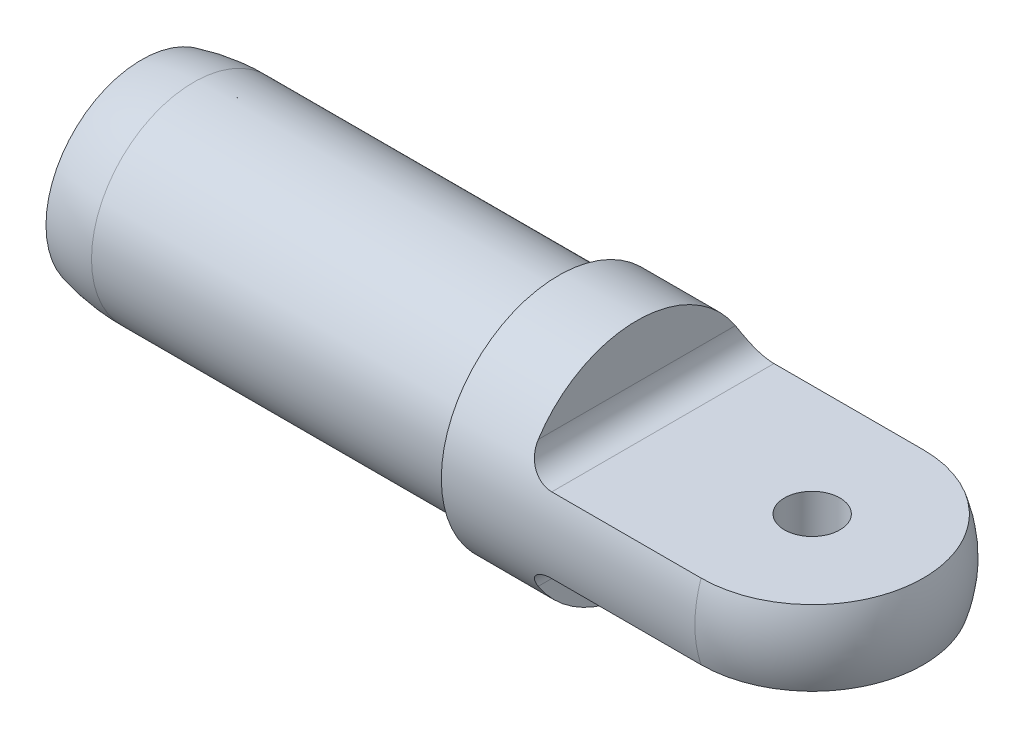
ISO-10303-21;
HEADER;
FILE_DESCRIPTION(('STEP AP214'),'2;1');
FILE_NAME('part.step','',(''),(''),'','','');
FILE_SCHEMA(('AUTOMOTIVE_DESIGN { 1 0 10303 214 1 1 1 1 }'));
ENDSEC;
DATA;
#1=APPLICATION_CONTEXT('core data for automotive mechanical design processes');
#2=APPLICATION_PROTOCOL_DEFINITION('international standard','automotive_design',2000,#1);
#3=PRODUCT_CONTEXT('',#1,'mechanical');
#4=PRODUCT('Part','Part','',(#3));
#5=PRODUCT_RELATED_PRODUCT_CATEGORY('part','',(#4));
#6=PRODUCT_DEFINITION_FORMATION('','',#4);
#7=PRODUCT_DEFINITION_CONTEXT('part definition',#1,'design');
#8=PRODUCT_DEFINITION('design','',#6,#7);
#9=PRODUCT_DEFINITION_SHAPE('','',#8);
#10=(LENGTH_UNIT() NAMED_UNIT(*) SI_UNIT(.MILLI.,.METRE.));
#11=(NAMED_UNIT(*) PLANE_ANGLE_UNIT() SI_UNIT($,.RADIAN.));
#12=(NAMED_UNIT(*) SI_UNIT($,.STERADIAN.) SOLID_ANGLE_UNIT());
#13=UNCERTAINTY_MEASURE_WITH_UNIT(LENGTH_MEASURE(1.E-05),#10,'distance_accuracy_value','');
#14=(GEOMETRIC_REPRESENTATION_CONTEXT(3) GLOBAL_UNCERTAINTY_ASSIGNED_CONTEXT((#13)) GLOBAL_UNIT_ASSIGNED_CONTEXT((#10,
#11,#12)) REPRESENTATION_CONTEXT('',''));
#15=CARTESIAN_POINT('',(0.,0.,0.));
#16=DIRECTION('',(0.,0.,1.));
#17=DIRECTION('',(1.,0.,0.));
#18=AXIS2_PLACEMENT_3D('',#15,#16,#17);
#19=CARTESIAN_POINT('',(-63.5469861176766,35.8499879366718,-55.5576157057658));
#20=DIRECTION('',(-1.,0.,0.));
#21=DIRECTION('',(0.,0.,1.));
#22=AXIS2_PLACEMENT_3D('',#19,#20,#21);
#23=CYLINDRICAL_SURFACE('',#22,14.2875);
#24=CARTESIAN_POINT('',(-12.7469861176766,35.8499879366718,-55.5576157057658));
#25=DIRECTION('',(-1.,0.,0.));
#26=DIRECTION('',(0.,0.,1.));
#27=AXIS2_PLACEMENT_3D('',#24,#25,#26);
#28=CIRCLE('',#27,14.2875);
#29=CARTESIAN_POINT('',(-12.7469861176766,35.8499879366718,-41.2701157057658));
#30=VERTEX_POINT('',#29);
#31=EDGE_CURVE('E166',#30,#30,#28,.T.);
#32=ORIENTED_EDGE('',*,*,#31,.F.);
#33=EDGE_LOOP('',(#32));
#34=FACE_BOUND('',#33,.T.);
#35=CARTESIAN_POINT('',(18.1394138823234,35.8499879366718,-55.5576157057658));
#36=DIRECTION('',(-1.,0.,0.));
#37=DIRECTION('',(0.,0.,1.));
#38=AXIS2_PLACEMENT_3D('',#35,#36,#37);
#39=CIRCLE('',#38,14.2875);
#40=CARTESIAN_POINT('',(18.1394138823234,31.2779879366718,-42.021387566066));
#41=VERTEX_POINT('',#40);
#42=CARTESIAN_POINT('',(18.1394138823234,40.4219879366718,-42.021387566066));
#43=VERTEX_POINT('',#42);
#44=EDGE_CURVE('E178',#41,#43,#39,.T.);
#45=ORIENTED_EDGE('',*,*,#44,.T.);
#46=DIRECTION('',(-1.,0.,0.));
#47=VECTOR('',#46,1.);
#48=CARTESIAN_POINT('',(-63.5469861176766,40.4219879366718,-42.021387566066));
#49=LINE('',#48,#47);
#50=CARTESIAN_POINT('',(-0.0469861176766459,40.4219879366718,-42.021387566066));
#51=VERTEX_POINT('',#50);
#52=EDGE_CURVE('E55',#43,#51,#49,.T.);
#53=ORIENTED_EDGE('',*,*,#52,.T.);
#54=CARTESIAN_POINT('',(3.12801388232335,43.5969879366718,-43.5527563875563));
#55=CARTESIAN_POINT('',(3.12801237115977,43.4146458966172,-43.4350926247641));
#56=CARTESIAN_POINT('',(3.11229997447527,43.2294096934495,-43.3214807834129));
#57=CARTESIAN_POINT('',(3.0465874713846,42.8581098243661,-43.1051052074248));
#58=CARTESIAN_POINT('',(2.9965434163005,42.6720454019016,-43.0023555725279));
#59=CARTESIAN_POINT('',(2.89424941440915,42.3972211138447,-42.8581148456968));
#60=CARTESIAN_POINT('',(2.85541806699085,42.3059946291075,-42.8115276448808));
#61=CARTESIAN_POINT('',(2.76855659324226,42.1261732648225,-42.7220323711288));
#62=CARTESIAN_POINT('',(2.72053089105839,42.0375771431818,-42.6791225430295));
#63=CARTESIAN_POINT('',(2.61536903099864,41.8641368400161,-42.5972193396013));
#64=CARTESIAN_POINT('',(2.55823824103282,41.7792904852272,-42.5582236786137));
#65=CARTESIAN_POINT('',(2.43508119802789,41.6144270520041,-42.4842819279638));
#66=CARTESIAN_POINT('',(2.36905633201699,41.5344092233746,-42.449335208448));
#67=CARTESIAN_POINT('',(2.23707981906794,41.3897140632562,-42.3875925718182));
#68=CARTESIAN_POINT('',(2.17209580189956,41.324354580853,-42.3603222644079));
#69=CARTESIAN_POINT('',(2.03595623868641,41.1989589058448,-42.3090023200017));
#70=CARTESIAN_POINT('',(1.96479863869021,41.1389244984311,-42.2849537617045));
#71=CARTESIAN_POINT('',(1.81687748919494,41.0249569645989,-42.2401045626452));
#72=CARTESIAN_POINT('',(1.74011810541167,40.9710193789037,-42.2193015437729));
#73=CARTESIAN_POINT('',(1.58154606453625,40.8698332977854,-42.1808921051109));
#74=CARTESIAN_POINT('',(1.49973167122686,40.822587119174,-42.1632867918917));
#75=CARTESIAN_POINT('',(1.26188762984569,40.6991583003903,-42.1179177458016));
#76=CARTESIAN_POINT('',(1.10059529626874,40.6314854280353,-42.0938427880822));
#77=CARTESIAN_POINT('',(0.768094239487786,40.523412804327,-42.055946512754));
#78=CARTESIAN_POINT('',(0.596887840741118,40.4830066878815,-42.0421228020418));
#79=CARTESIAN_POINT('',(0.255011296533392,40.4318086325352,-42.0246824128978));
#80=CARTESIAN_POINT('',(0.0844877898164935,40.4201408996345,-42.0207637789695));
#81=CARTESIAN_POINT('',(-0.256173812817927,40.4243105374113,-42.0221719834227));
#82=CARTESIAN_POINT('',(-0.426311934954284,40.4401459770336,-42.0274981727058));
#83=CARTESIAN_POINT('',(-0.760185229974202,40.4985209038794,-42.0474445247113));
#84=CARTESIAN_POINT('',(-0.923955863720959,40.5408794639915,-42.0620017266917));
#85=CARTESIAN_POINT('',(-1.24171205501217,40.650548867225,-42.1006239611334));
#86=CARTESIAN_POINT('',(-1.39569791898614,40.717858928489,-42.1246886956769));
#87=CARTESIAN_POINT('',(-1.69068177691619,40.8754028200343,-42.1828289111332));
#88=CARTESIAN_POINT('',(-1.83159034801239,40.9657805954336,-42.2169674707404));
#89=CARTESIAN_POINT('',(-2.09575594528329,41.1658101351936,-42.2954062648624));
#90=CARTESIAN_POINT('',(-2.21901215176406,41.2754627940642,-42.3397069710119));
#91=CARTESIAN_POINT('',(-2.44831000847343,41.5131765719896,-42.4397659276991));
#92=CARTESIAN_POINT('',(-2.55379749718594,41.6416545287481,-42.495801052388));
#93=CARTESIAN_POINT('',(-2.74172583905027,41.910019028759,-42.6181248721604));
#94=CARTESIAN_POINT('',(-2.82416180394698,42.0499079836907,-42.6844157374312));
#95=CARTESIAN_POINT('',(-2.97014594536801,42.3460709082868,-42.8311625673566));
#96=CARTESIAN_POINT('',(-3.03208013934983,42.5028163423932,-42.912266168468));
#97=CARTESIAN_POINT('',(-3.12971672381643,42.8192609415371,-43.0838693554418));
#98=CARTESIAN_POINT('',(-3.16540689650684,42.9789614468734,-43.1743732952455));
#99=CARTESIAN_POINT('',(-3.21467762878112,43.3163151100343,-43.3744522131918));
#100=CARTESIAN_POINT('',(-3.2251132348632,43.4938375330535,-43.4850143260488));
#101=CARTESIAN_POINT('',(-3.2172445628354,43.8433193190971,-43.7135033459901));
#102=CARTESIAN_POINT('',(-3.19893105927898,44.0152768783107,-43.8314326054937));
#103=CARTESIAN_POINT('',(-3.13098358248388,44.3771365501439,-44.0912525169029));
#104=CARTESIAN_POINT('',(-3.07686182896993,44.5655863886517,-44.2339869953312));
#105=CARTESIAN_POINT('',(-2.93606512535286,44.9280579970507,-44.5224433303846));
#106=CARTESIAN_POINT('',(-2.84933008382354,45.1020524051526,-44.6681702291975));
#107=CARTESIAN_POINT('',(-2.68935399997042,45.3606739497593,-44.8948277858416));
#108=CARTESIAN_POINT('',(-2.62658180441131,45.4513253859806,-44.9764432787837));
#109=CARTESIAN_POINT('',(-2.49112696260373,45.626536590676,-45.1381177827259));
#110=CARTESIAN_POINT('',(-2.4184410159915,45.7110943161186,-45.218176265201));
#111=CARTESIAN_POINT('',(-2.26323558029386,45.8732652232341,-45.3753127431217));
#112=CARTESIAN_POINT('',(-2.18073575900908,45.9508917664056,-45.4523963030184));
#113=CARTESIAN_POINT('',(-2.0056060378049,46.0984946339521,-45.6021243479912));
#114=CARTESIAN_POINT('',(-1.91298418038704,46.1684769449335,-45.6747722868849));
#115=CARTESIAN_POINT('',(-1.70342063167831,46.3089870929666,-45.823456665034));
#116=CARTESIAN_POINT('',(-1.58489108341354,46.3782024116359,-45.898528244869));
#117=CARTESIAN_POINT('',(-1.33407922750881,46.5027661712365,-46.0360834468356));
#118=CARTESIAN_POINT('',(-1.20182168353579,46.5581389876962,-46.0985891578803));
#119=CARTESIAN_POINT('',(-0.950351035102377,46.6430875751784,-46.1957228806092));
#120=CARTESIAN_POINT('',(-0.833303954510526,46.6755483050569,-46.2333758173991));
#121=CARTESIAN_POINT('',(-0.592563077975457,46.72717593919,-46.2936513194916));
#122=CARTESIAN_POINT('',(-0.468875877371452,46.7463557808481,-46.3162885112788));
#123=CARTESIAN_POINT('',(-0.217346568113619,46.7699408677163,-46.344166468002));
#124=CARTESIAN_POINT('',(-0.0894842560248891,46.774258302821,-46.3493038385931));
#125=CARTESIAN_POINT('',(0.16524339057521,46.7674487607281,-46.3412320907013));
#126=CARTESIAN_POINT('',(0.292108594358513,46.7563197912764,-46.3280206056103));
#127=CARTESIAN_POINT('',(0.529771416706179,46.7212719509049,-46.2867760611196));
#128=CARTESIAN_POINT('',(0.641003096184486,46.6985587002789,-46.2601425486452));
#129=CARTESIAN_POINT('',(0.857172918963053,46.6425761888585,-46.195215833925));
#130=CARTESIAN_POINT('',(0.962108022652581,46.609301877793,-46.1569170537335));
#131=CARTESIAN_POINT('',(1.21840650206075,46.5136289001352,-46.0483037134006));
#132=CARTESIAN_POINT('',(1.36485980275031,46.4451449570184,-45.9717843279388));
#133=CARTESIAN_POINT('',(1.63990935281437,46.2914207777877,-45.8045610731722));
#134=CARTESIAN_POINT('',(1.76845531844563,46.2061349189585,-45.7138187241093));
#135=CARTESIAN_POINT('',(1.97249493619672,46.0492527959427,-45.5517987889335));
#136=CARTESIAN_POINT('',(2.05243199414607,45.9810726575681,-45.482706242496));
#137=CARTESIAN_POINT('',(2.20384628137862,45.8386810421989,-45.3415132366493));
#138=CARTESIAN_POINT('',(2.27532011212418,45.7644671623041,-45.2694115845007));
#139=CARTESIAN_POINT('',(2.47739848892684,45.5334811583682,-45.0501197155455));
#140=CARTESIAN_POINT('',(2.59562376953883,45.368393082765,-44.8999723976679));
#141=CARTESIAN_POINT('',(2.7488204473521,45.105195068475,-44.6724061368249));
#142=CARTESIAN_POINT('',(2.79625215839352,45.01375241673,-44.5952821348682));
#143=CARTESIAN_POINT('',(2.88212122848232,44.826452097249,-44.4413911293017));
#144=CARTESIAN_POINT('',(2.92055827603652,44.7305942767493,-44.3646241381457));
#145=CARTESIAN_POINT('',(3.02167696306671,44.4375201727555,-44.1362394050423));
#146=CARTESIAN_POINT('',(3.07056393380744,44.2341220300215,-43.9859443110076));
#147=CARTESIAN_POINT('',(3.10856037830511,43.9550071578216,-43.7911915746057));
#148=CARTESIAN_POINT('',(3.11580864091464,43.8841707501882,-43.7427114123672));
#149=CARTESIAN_POINT('',(3.12553683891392,43.7413713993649,-43.6468595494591));
#150=CARTESIAN_POINT('',(3.12801448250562,43.6694079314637,-43.5994883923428));
#151=CARTESIAN_POINT('',(3.12801388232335,43.5969879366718,-43.5527563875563));
#152=B_SPLINE_CURVE_WITH_KNOTS('',3,(#54,#55,#56,#57,#58,#59,#60,#61,#62,#63,#64,#65,#66,#67,
#68,#69,#70,#71,#72,#73,#74,#75,#76,#77,#78,#79,#80,#81,#82,#83,#84,#85,#86,#87,#88,#89,#90,#91,
#92,#93,#94,#95,#96,#97,#98,#99,#100,#101,#102,#103,#104,#105,#106,#107,#108,#109,#110,#111,
#112,#113,#114,#115,#116,#117,#118,#119,#120,#121,#122,#123,#124,#125,#126,#127,#128,#129,#130,
#131,#132,#133,#134,#135,#136,#137,#138,#139,#140,#141,#142,#143,#144,#145,#146,#147,#148,#149,
#150,#151),.UNSPECIFIED.,.T.,.F.,(4,2,2,2,2,2,2,2,2,2,2,2,2,2,2,2,2,2,2,2,2,2,2,2,2,2,2,2,2,2,2,
2,2,2,2,2,2,2,2,2,2,2,2,2,2,2,2,2,4),(0.,0.650749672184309,1.30233394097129,1.63057110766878,
1.95865072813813,2.28653763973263,2.61437347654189,2.90233929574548,3.19040129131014,
3.47825121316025,3.76620055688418,4.29302643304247,4.81972928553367,5.33017069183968,
5.84057626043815,6.34753747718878,6.85448280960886,7.36467236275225,7.87488559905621,
8.39886421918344,8.92295386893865,9.48177939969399,10.0408649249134,10.6666368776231,
11.292609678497,12.0173960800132,12.7435245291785,13.1546522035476,13.5659170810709,
13.9763712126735,14.3865015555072,14.854420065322,15.3215087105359,15.7015033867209,
16.0811273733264,16.4629904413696,16.844902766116,17.1933641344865,17.5419923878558,
18.0756128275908,18.6107027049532,18.9874664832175,19.3643810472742,20.1183726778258,
20.5041132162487,20.8898671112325,21.6584430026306,21.9167743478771,22.175229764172),.UNSPECIFIED.);
#153=CARTESIAN_POINT('',(-3.22198611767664,43.5969879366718,-43.5527563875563));
#154=VERTEX_POINT('',#153);
#155=EDGE_CURVE('E11',#51,#154,#152,.T.);
#156=ORIENTED_EDGE('',*,*,#155,.T.);
#157=CARTESIAN_POINT('',(-3.22198611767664,35.8499879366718,-55.5576157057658));
#158=DIRECTION('',(-1.,0.,0.));
#159=DIRECTION('',(0.,-1.,0.));
#160=AXIS2_PLACEMENT_3D('',#157,#158,#159);
#161=CIRCLE('',#160,14.2875);
#162=CARTESIAN_POINT('',(-3.22198611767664,43.5969879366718,-67.5624750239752));
#163=VERTEX_POINT('',#162);
#164=EDGE_CURVE('E111',#154,#163,#161,.T.);
#165=ORIENTED_EDGE('',*,*,#164,.T.);
#166=CARTESIAN_POINT('',(3.12801388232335,43.5969879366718,-67.5624750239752));
#167=CARTESIAN_POINT('',(3.128013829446,43.7102427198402,-67.489388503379));
#168=CARTESIAN_POINT('',(3.12195216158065,43.8224876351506,-67.4146777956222));
#169=CARTESIAN_POINT('',(3.09835804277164,44.0440484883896,-67.2626620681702));
#170=CARTESIAN_POINT('',(3.08081695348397,44.1533621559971,-67.1853551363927));
#171=CARTESIAN_POINT('',(3.03478663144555,44.3686454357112,-67.0285748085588));
#172=CARTESIAN_POINT('',(3.00626096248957,44.4746026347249,-66.9490950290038));
#173=CARTESIAN_POINT('',(2.93881567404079,44.682123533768,-66.7889676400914));
#174=CARTESIAN_POINT('',(2.89989840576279,44.7836882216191,-66.7083202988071));
#175=CARTESIAN_POINT('',(2.77116258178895,45.0743236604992,-66.4711406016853));
#176=CARTESIAN_POINT('',(2.66765872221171,45.2569631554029,-66.3137641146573));
#177=CARTESIAN_POINT('',(2.48579569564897,45.5144528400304,-66.081126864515));
#178=CARTESIAN_POINT('',(2.42075766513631,45.5975210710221,-66.0041691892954));
#179=CARTESIAN_POINT('',(2.28170477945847,45.7577904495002,-65.8522870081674));
#180=CARTESIAN_POINT('',(2.20769279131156,45.8349934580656,-65.7773618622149));
#181=CARTESIAN_POINT('',(2.01459132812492,46.0167598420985,-65.5971568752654));
#182=CARTESIAN_POINT('',(1.89035641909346,46.1177076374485,-65.4936490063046));
#183=CARTESIAN_POINT('',(1.62175917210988,46.3029909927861,-65.298530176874));
#184=CARTESIAN_POINT('',(1.47742974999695,46.3873531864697,-65.2069002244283));
#185=CARTESIAN_POINT('',(1.2096147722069,46.5154355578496,-65.0648490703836));
#186=CARTESIAN_POINT('',(1.09084606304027,46.5639936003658,-65.0099563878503));
#187=CARTESIAN_POINT('',(0.843146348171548,46.6474451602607,-64.9145171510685));
#188=CARTESIAN_POINT('',(0.714231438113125,46.6823598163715,-64.8739484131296));
#189=CARTESIAN_POINT('',(0.46852943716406,46.7319747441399,-64.81592385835));
#190=CARTESIAN_POINT('',(0.352806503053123,46.7489152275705,-64.7959210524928));
#191=CARTESIAN_POINT('',(0.11859223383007,46.7698417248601,-64.7711779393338));
#192=CARTESIAN_POINT('',(0.000102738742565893,46.7738361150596,-64.7664277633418));
#193=CARTESIAN_POINT('',(-0.236173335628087,46.7685496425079,-64.7726945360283));
#194=CARTESIAN_POINT('',(-0.353959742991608,46.7592656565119,-64.7837151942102));
#195=CARTESIAN_POINT('',(-0.585530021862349,46.7281671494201,-64.8203600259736));
#196=CARTESIAN_POINT('',(-0.699310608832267,46.7063425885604,-64.8459959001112));
#197=CARTESIAN_POINT('',(-0.951767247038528,46.643846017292,-64.9186065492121));
#198=CARTESIAN_POINT('',(-1.08839893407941,46.5995918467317,-64.9695631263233));
#199=CARTESIAN_POINT('',(-1.34903227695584,46.4961380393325,-65.0864268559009));
#200=CARTESIAN_POINT('',(-1.47300561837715,46.4369058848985,-65.1523665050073));
#201=CARTESIAN_POINT('',(-1.75814426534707,46.2782963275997,-65.3250061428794));
#202=CARTESIAN_POINT('',(-1.91250912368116,46.1725884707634,-65.437070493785));
#203=CARTESIAN_POINT('',(-2.19549504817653,45.9417580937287,-65.6727625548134));
#204=CARTESIAN_POINT('',(-2.32408440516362,45.81661199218,-65.7964042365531));
#205=CARTESIAN_POINT('',(-2.56066475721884,45.5452165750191,-66.0538752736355));
#206=CARTESIAN_POINT('',(-2.667732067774,45.3983635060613,-66.1879117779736));
#207=CARTESIAN_POINT('',(-2.85510320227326,45.0895380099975,-66.4574026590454));
#208=CARTESIAN_POINT('',(-2.93540002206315,44.9275616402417,-66.5928573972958));
#209=CARTESIAN_POINT('',(-3.0420703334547,44.6563751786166,-66.8091748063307));
#210=CARTESIAN_POINT('',(-3.07727010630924,44.5511434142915,-66.8907808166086));
#211=CARTESIAN_POINT('',(-3.1366780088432,44.3364661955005,-67.0524130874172));
#212=CARTESIAN_POINT('',(-3.16088972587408,44.227022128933,-67.1324398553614));
#213=CARTESIAN_POINT('',(-3.19772634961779,44.0046133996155,-67.2901906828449));
#214=CARTESIAN_POINT('',(-3.21035486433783,43.8916498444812,-67.3679154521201));
#215=CARTESIAN_POINT('',(-3.22336154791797,43.66308047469,-67.520355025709));
#216=CARTESIAN_POINT('',(-3.22374359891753,43.5474755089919,-67.5950707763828));
#217=CARTESIAN_POINT('',(-3.20819552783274,43.2505634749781,-67.7809252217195));
#218=CARTESIAN_POINT('',(-3.18319257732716,43.0680378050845,-67.8895344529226));
#219=CARTESIAN_POINT('',(-3.09956799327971,42.7041789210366,-68.0954107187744));
#220=CARTESIAN_POINT('',(-3.04096869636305,42.5228449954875,-68.1926852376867));
#221=CARTESIAN_POINT('',(-2.92672486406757,42.2563902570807,-68.3287091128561));
#222=CARTESIAN_POINT('',(-2.8840337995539,42.1681628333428,-68.3725540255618));
#223=CARTESIAN_POINT('',(-2.78982877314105,41.9947531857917,-68.4565986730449));
#224=CARTESIAN_POINT('',(-2.73831904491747,41.9095695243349,-68.4968001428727));
#225=CARTESIAN_POINT('',(-2.62661030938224,41.7432891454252,-68.5733771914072));
#226=CARTESIAN_POINT('',(-2.56641214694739,41.6621920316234,-68.6097531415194));
#227=CARTESIAN_POINT('',(-2.43762371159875,41.5051506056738,-68.6785584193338));
#228=CARTESIAN_POINT('',(-2.36903459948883,41.4292055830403,-68.710988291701));
#229=CARTESIAN_POINT('',(-2.23247362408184,41.2921016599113,-68.768252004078));
#230=CARTESIAN_POINT('',(-2.16537761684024,41.2302541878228,-68.7935306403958));
#231=CARTESIAN_POINT('',(-2.02542077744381,41.112070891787,-68.8409584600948));
#232=CARTESIAN_POINT('',(-1.95255803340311,41.0557369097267,-68.8631065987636));
#233=CARTESIAN_POINT('',(-1.80166142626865,40.9492997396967,-68.9042607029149));
#234=CARTESIAN_POINT('',(-1.72363160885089,40.8991917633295,-68.9232690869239));
#235=CARTESIAN_POINT('',(-1.5629605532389,40.8057333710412,-68.9582025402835));
#236=CARTESIAN_POINT('',(-1.48031771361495,40.7623853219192,-68.9741265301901));
#237=CARTESIAN_POINT('',(-1.23936406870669,40.6493470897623,-69.0151395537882));
#238=CARTESIAN_POINT('',(-1.07619158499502,40.5883997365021,-69.0365838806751));
#239=CARTESIAN_POINT('',(-0.741238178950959,40.4939319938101,-69.0694241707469));
#240=CARTESIAN_POINT('',(-0.569458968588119,40.4604061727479,-69.0808221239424));
#241=CARTESIAN_POINT('',(-0.226992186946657,40.4225439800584,-69.0936703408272));
#242=CARTESIAN_POINT('',(-0.0563979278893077,40.417452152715,-69.0953780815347));
#243=CARTESIAN_POINT('',(0.283237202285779,40.4346328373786,-69.0895693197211));
#244=CARTESIAN_POINT('',(0.452278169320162,40.4569036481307,-69.082053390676));
#245=CARTESIAN_POINT('',(0.783145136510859,40.5277881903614,-69.0576978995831));
#246=CARTESIAN_POINT('',(0.945003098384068,40.5762691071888,-69.0409053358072));
#247=CARTESIAN_POINT('',(1.25789788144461,40.6976667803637,-68.9977343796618));
#248=CARTESIAN_POINT('',(1.40893488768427,40.7705831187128,-68.9713561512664));
#249=CARTESIAN_POINT('',(1.69735440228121,40.9387935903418,-68.908451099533));
#250=CARTESIAN_POINT('',(1.83461516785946,41.0342658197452,-68.8718430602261));
#251=CARTESIAN_POINT('',(2.09069420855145,41.2436267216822,-68.7884124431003));
#252=CARTESIAN_POINT('',(2.20951256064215,41.3575153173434,-68.7415899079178));
#253=CARTESIAN_POINT('',(2.42963511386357,41.6032465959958,-68.6362639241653));
#254=CARTESIAN_POINT('',(2.5302960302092,41.7355302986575,-68.5774482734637));
#255=CARTESIAN_POINT('',(2.7081366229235,42.0105537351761,-68.4495932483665));
#256=CARTESIAN_POINT('',(2.78530295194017,42.1532993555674,-68.3805480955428));
#257=CARTESIAN_POINT('',(2.92058347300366,42.4552797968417,-68.2277946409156));
#258=CARTESIAN_POINT('',(2.97690223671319,42.6149585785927,-68.1433848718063));
#259=CARTESIAN_POINT('',(3.06291541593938,42.9361169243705,-67.9653989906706));
#260=CARTESIAN_POINT('',(3.09263517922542,43.0975946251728,-67.871831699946));
#261=CARTESIAN_POINT('',(3.11596861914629,43.3148167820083,-67.7401214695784));
#262=CARTESIAN_POINT('',(3.12050556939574,43.3715352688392,-67.705184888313));
#263=CARTESIAN_POINT('',(3.1265277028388,43.4845809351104,-67.6344564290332));
#264=CARTESIAN_POINT('',(3.12801390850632,43.5409082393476,-67.5986648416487));
#265=CARTESIAN_POINT('',(3.12801388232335,43.5969879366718,-67.5624750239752));
#266=B_SPLINE_CURVE_WITH_KNOTS('',3,(#166,#167,#168,#169,#170,#171,#172,#173,#174,#175,#176,
#177,#178,#179,#180,#181,#182,#183,#184,#185,#186,#187,#188,#189,#190,#191,#192,#193,#194,#195,
#196,#197,#198,#199,#200,#201,#202,#203,#204,#205,#206,#207,#208,#209,#210,#211,#212,#213,#214,
#215,#216,#217,#218,#219,#220,#221,#222,#223,#224,#225,#226,#227,#228,#229,#230,#231,#232,#233,
#234,#235,#236,#237,#238,#239,#240,#241,#242,#243,#244,#245,#246,#247,#248,#249,#250,#251,#252,
#253,#254,#255,#256,#257,#258,#259,#260,#261,#262,#263,#264,#265),.UNSPECIFIED.,.T.,.F.,(4,2,2,
2,2,2,2,2,2,2,2,2,2,2,2,2,2,2,2,2,2,2,2,2,2,2,2,2,2,2,2,2,2,2,2,2,2,2,2,2,2,2,2,2,2,2,2,2,2,4),
(0.,0.404290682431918,0.808885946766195,1.21483499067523,1.62069226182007,2.40387106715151,
2.79528543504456,3.18657508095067,3.75664330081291,4.32578847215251,4.74304216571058,
5.15964678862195,5.51403237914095,5.86818863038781,6.22242819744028,6.57695175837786,
7.03160059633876,7.48724509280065,8.13796276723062,8.78947611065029,9.46478123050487,
10.1402628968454,10.5530376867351,10.9656776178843,11.3781889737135,11.7905695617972,
12.4294036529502,13.0678135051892,13.3895412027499,13.7111148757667,14.0326572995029,
14.3541552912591,14.6378477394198,14.9216346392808,15.2052019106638,15.4888682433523,
16.0125367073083,16.5361014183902,17.0456869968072,17.5552408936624,18.0622366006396,
18.5692236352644,19.0803560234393,19.5914862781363,20.1181765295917,20.6451654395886,
21.2105098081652,21.7753148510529,21.9755721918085,22.1757624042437),.UNSPECIFIED.);
#267=CARTESIAN_POINT('',(-0.0469861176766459,40.4219879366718,-69.0938438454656));
#268=VERTEX_POINT('',#267);
#269=EDGE_CURVE('E48',#163,#268,#266,.T.);
#270=ORIENTED_EDGE('',*,*,#269,.T.);
#271=DIRECTION('',(-1.,0.,0.));
#272=VECTOR('',#271,1.);
#273=CARTESIAN_POINT('',(-63.5469861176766,40.4219879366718,-69.0938438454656));
#274=LINE('',#273,#272);
#275=CARTESIAN_POINT('',(18.1394138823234,40.4219879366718,-69.0938438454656));
#276=VERTEX_POINT('',#275);
#277=EDGE_CURVE('E96',#268,#276,#274,.F.);
#278=ORIENTED_EDGE('',*,*,#277,.T.);
#279=CARTESIAN_POINT('',(18.1394138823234,31.2779879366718,-69.0938438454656));
#280=VERTEX_POINT('',#279);
#281=EDGE_CURVE('E63',#276,#280,#39,.T.);
#282=ORIENTED_EDGE('',*,*,#281,.T.);
#283=DIRECTION('',(-1.,0.,0.));
#284=VECTOR('',#283,1.);
#285=CARTESIAN_POINT('',(-63.5469861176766,31.2779879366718,-69.0938438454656));
#286=LINE('',#285,#284);
#287=CARTESIAN_POINT('',(-0.0469861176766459,31.2779879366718,-69.0938438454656));
#288=VERTEX_POINT('',#287);
#289=EDGE_CURVE('E180',#280,#288,#286,.T.);
#290=ORIENTED_EDGE('',*,*,#289,.T.);
#291=CARTESIAN_POINT('',(3.12801388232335,28.1029879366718,-67.5624750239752));
#292=CARTESIAN_POINT('',(3.12801237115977,28.2853299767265,-67.6801387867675));
#293=CARTESIAN_POINT('',(3.11229997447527,28.4705661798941,-67.7937506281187));
#294=CARTESIAN_POINT('',(3.0465874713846,28.8418660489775,-68.0101262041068));
#295=CARTESIAN_POINT('',(2.9965434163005,29.027930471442,-68.1128758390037));
#296=CARTESIAN_POINT('',(2.89424941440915,29.302754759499,-68.2571165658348));
#297=CARTESIAN_POINT('',(2.85541806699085,29.3939812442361,-68.3037037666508));
#298=CARTESIAN_POINT('',(2.76855659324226,29.5738026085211,-68.3931990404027));
#299=CARTESIAN_POINT('',(2.7205308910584,29.6623987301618,-68.4361088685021));
#300=CARTESIAN_POINT('',(2.61536903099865,29.8358390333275,-68.5180120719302));
#301=CARTESIAN_POINT('',(2.55823824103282,29.9206853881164,-68.5570077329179));
#302=CARTESIAN_POINT('',(2.4350811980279,30.0855488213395,-68.6309494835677));
#303=CARTESIAN_POINT('',(2.36905633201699,30.165566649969,-68.6658962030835));
#304=CARTESIAN_POINT('',(2.23707981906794,30.3102618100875,-68.7276388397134));
#305=CARTESIAN_POINT('',(2.17209580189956,30.3756212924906,-68.7549091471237));
#306=CARTESIAN_POINT('',(2.03595623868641,30.5010169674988,-68.8062290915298));
#307=CARTESIAN_POINT('',(1.96479863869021,30.5610513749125,-68.8302776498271));
#308=CARTESIAN_POINT('',(1.81687748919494,30.6750189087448,-68.8751268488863));
#309=CARTESIAN_POINT('',(1.74011810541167,30.7289564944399,-68.8959298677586));
#310=CARTESIAN_POINT('',(1.58154606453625,30.8301425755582,-68.9343393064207));
#311=CARTESIAN_POINT('',(1.49973167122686,30.8773887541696,-68.9519446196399));
#312=CARTESIAN_POINT('',(1.26188762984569,31.0008175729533,-68.99731366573));
#313=CARTESIAN_POINT('',(1.10059529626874,31.0684904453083,-69.0213886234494));
#314=CARTESIAN_POINT('',(0.768094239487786,31.1765630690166,-69.0592848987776));
#315=CARTESIAN_POINT('',(0.596887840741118,31.2169691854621,-69.0731086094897));
#316=CARTESIAN_POINT('',(0.255011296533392,31.2681672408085,-69.0905489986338));
#317=CARTESIAN_POINT('',(0.0844877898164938,31.2798349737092,-69.0944676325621));
#318=CARTESIAN_POINT('',(-0.256173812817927,31.2756653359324,-69.0930594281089));
#319=CARTESIAN_POINT('',(-0.426311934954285,31.25982989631,-69.0877332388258));
#320=CARTESIAN_POINT('',(-0.760185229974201,31.2014549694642,-69.0677868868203));
#321=CARTESIAN_POINT('',(-0.923955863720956,31.1590964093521,-69.0532296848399));
#322=CARTESIAN_POINT('',(-1.24171205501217,31.0494270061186,-69.0146074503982));
#323=CARTESIAN_POINT('',(-1.39569791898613,30.9821169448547,-68.9905427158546));
#324=CARTESIAN_POINT('',(-1.69068177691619,30.8245730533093,-68.9324025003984));
#325=CARTESIAN_POINT('',(-1.83159034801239,30.73419527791,-68.8982639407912));
#326=CARTESIAN_POINT('',(-2.09575594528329,30.5341657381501,-68.8198251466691));
#327=CARTESIAN_POINT('',(-2.21901215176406,30.4245130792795,-68.7755244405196));
#328=CARTESIAN_POINT('',(-2.44831000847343,30.186799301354,-68.6754654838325));
#329=CARTESIAN_POINT('',(-2.55379749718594,30.0583213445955,-68.6194303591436));
#330=CARTESIAN_POINT('',(-2.74172583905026,29.7899568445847,-68.4971065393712));
#331=CARTESIAN_POINT('',(-2.82416180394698,29.6500678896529,-68.4308156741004));
#332=CARTESIAN_POINT('',(-2.97014594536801,29.3539049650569,-68.284068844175));
#333=CARTESIAN_POINT('',(-3.03208013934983,29.1971595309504,-68.2029652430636));
#334=CARTESIAN_POINT('',(-3.12971672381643,28.8807149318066,-68.0313620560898));
#335=CARTESIAN_POINT('',(-3.16540689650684,28.7210144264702,-67.9408581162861));
#336=CARTESIAN_POINT('',(-3.21467762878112,28.3836607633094,-67.7407791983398));
#337=CARTESIAN_POINT('',(-3.2251132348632,28.2061383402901,-67.6302170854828));
#338=CARTESIAN_POINT('',(-3.2172445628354,27.8566565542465,-67.4017280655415));
#339=CARTESIAN_POINT('',(-3.19893105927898,27.6846989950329,-67.2837988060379));
#340=CARTESIAN_POINT('',(-3.13098358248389,27.3228393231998,-67.0239788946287));
#341=CARTESIAN_POINT('',(-3.07686182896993,27.134389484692,-66.8812444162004));
#342=CARTESIAN_POINT('',(-2.93606512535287,26.771917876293,-66.5927880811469));
#343=CARTESIAN_POINT('',(-2.84933008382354,26.5979234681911,-66.4470611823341));
#344=CARTESIAN_POINT('',(-2.68935399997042,26.3393019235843,-66.22040362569));
#345=CARTESIAN_POINT('',(-2.62658180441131,26.248650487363,-66.1387881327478));
#346=CARTESIAN_POINT('',(-2.49112696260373,26.0734392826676,-65.9771136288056));
#347=CARTESIAN_POINT('',(-2.4184410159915,25.988881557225,-65.8970551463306));
#348=CARTESIAN_POINT('',(-2.26323558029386,25.8267106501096,-65.7399186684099));
#349=CARTESIAN_POINT('',(-2.18073575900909,25.749084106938,-65.6628351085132));
#350=CARTESIAN_POINT('',(-2.0056060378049,25.6014812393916,-65.5131070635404));
#351=CARTESIAN_POINT('',(-1.91298418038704,25.5314989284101,-65.4404591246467));
#352=CARTESIAN_POINT('',(-1.70342063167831,25.3909887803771,-65.2917747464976));
#353=CARTESIAN_POINT('',(-1.58489108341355,25.3217734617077,-65.2167031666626));
#354=CARTESIAN_POINT('',(-1.33407922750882,25.1972097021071,-65.079147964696));
#355=CARTESIAN_POINT('',(-1.20182168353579,25.1418368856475,-65.0166422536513));
#356=CARTESIAN_POINT('',(-0.950351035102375,25.0568882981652,-64.9195085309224));
#357=CARTESIAN_POINT('',(-0.833303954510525,25.0244275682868,-64.8818555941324));
#358=CARTESIAN_POINT('',(-0.592563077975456,24.9727999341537,-64.82158009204));
#359=CARTESIAN_POINT('',(-0.468875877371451,24.9536200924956,-64.7989429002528));
#360=CARTESIAN_POINT('',(-0.217346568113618,24.9300350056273,-64.7710649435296));
#361=CARTESIAN_POINT('',(-0.089484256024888,24.9257175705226,-64.7659275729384));
#362=CARTESIAN_POINT('',(0.16524339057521,24.9325271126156,-64.7739993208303));
#363=CARTESIAN_POINT('',(0.292108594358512,24.9436560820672,-64.7872108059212));
#364=CARTESIAN_POINT('',(0.529771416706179,24.9787039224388,-64.8284553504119));
#365=CARTESIAN_POINT('',(0.641003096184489,25.0014171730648,-64.8550888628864));
#366=CARTESIAN_POINT('',(0.857172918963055,25.0573996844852,-64.9200155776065));
#367=CARTESIAN_POINT('',(0.96210802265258,25.0906739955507,-64.9583143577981));
#368=CARTESIAN_POINT('',(1.21840650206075,25.1863469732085,-65.066927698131));
#369=CARTESIAN_POINT('',(1.36485980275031,25.2548309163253,-65.1434470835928));
#370=CARTESIAN_POINT('',(1.63990935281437,25.408555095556,-65.3106703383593));
#371=CARTESIAN_POINT('',(1.76845531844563,25.4938409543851,-65.4014126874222));
#372=CARTESIAN_POINT('',(1.97249493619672,25.6507230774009,-65.5634326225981));
#373=CARTESIAN_POINT('',(2.05243199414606,25.7189032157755,-65.6325251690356));
#374=CARTESIAN_POINT('',(2.20384628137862,25.8612948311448,-65.7737181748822));
#375=CARTESIAN_POINT('',(2.27532011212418,25.9355087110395,-65.8458198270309));
#376=CARTESIAN_POINT('',(2.47739848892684,26.1664947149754,-66.0651116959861));
#377=CARTESIAN_POINT('',(2.59562376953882,26.3315827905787,-66.2152590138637));
#378=CARTESIAN_POINT('',(2.7488204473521,26.5947808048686,-66.4428252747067));
#379=CARTESIAN_POINT('',(2.79625215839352,26.6862234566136,-66.5199492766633));
#380=CARTESIAN_POINT('',(2.88212122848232,26.8735237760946,-66.6738402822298));
#381=CARTESIAN_POINT('',(2.92055827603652,26.9693815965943,-66.7506072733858));
#382=CARTESIAN_POINT('',(3.02167696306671,27.2624557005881,-66.9789920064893));
#383=CARTESIAN_POINT('',(3.07056393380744,27.4658538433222,-67.129287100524));
#384=CARTESIAN_POINT('',(3.10856037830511,27.744968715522,-67.3240398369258));
#385=CARTESIAN_POINT('',(3.11580864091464,27.8158051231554,-67.3725199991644));
#386=CARTESIAN_POINT('',(3.12553683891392,27.9586044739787,-67.4683718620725));
#387=CARTESIAN_POINT('',(3.12801448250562,28.03056794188,-67.5157430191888));
#388=CARTESIAN_POINT('',(3.12801388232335,28.1029879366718,-67.5624750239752));
#389=B_SPLINE_CURVE_WITH_KNOTS('',3,(#291,#292,#293,#294,#295,#296,#297,#298,#299,#300,#301,
#302,#303,#304,#305,#306,#307,#308,#309,#310,#311,#312,#313,#314,#315,#316,#317,#318,#319,#320,
#321,#322,#323,#324,#325,#326,#327,#328,#329,#330,#331,#332,#333,#334,#335,#336,#337,#338,#339,
#340,#341,#342,#343,#344,#345,#346,#347,#348,#349,#350,#351,#352,#353,#354,#355,#356,#357,#358,
#359,#360,#361,#362,#363,#364,#365,#366,#367,#368,#369,#370,#371,#372,#373,#374,#375,#376,#377,
#378,#379,#380,#381,#382,#383,#384,#385,#386,#387,#388),.UNSPECIFIED.,.T.,.F.,(4,2,2,2,2,2,2,2,
2,2,2,2,2,2,2,2,2,2,2,2,2,2,2,2,2,2,2,2,2,2,2,2,2,2,2,2,2,2,2,2,2,2,2,2,2,2,2,2,4),(0.,
0.650749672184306,1.30233394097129,1.63057110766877,1.95865072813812,2.28653763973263,
2.61437347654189,2.90233929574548,3.19040129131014,3.47825121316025,3.76620055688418,
4.29302643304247,4.81972928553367,5.33017069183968,5.84057626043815,6.34753747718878,
6.85448280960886,7.36467236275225,7.87488559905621,8.39886421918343,8.92295386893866,
9.48177939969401,10.0408649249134,10.6666368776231,11.292609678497,12.0173960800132,
12.7435245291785,13.1546522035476,13.5659170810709,13.9763712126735,14.3865015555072,
14.854420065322,15.3215087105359,15.701503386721,16.0811273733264,16.4629904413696,
16.844902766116,17.1933641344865,17.5419923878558,18.0756128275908,18.6107027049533,
18.9874664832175,19.3643810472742,20.1183726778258,20.5041132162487,20.8898671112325,
21.6584430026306,21.9167743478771,22.175229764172),.UNSPECIFIED.);
#390=CARTESIAN_POINT('',(-3.22198611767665,28.1029879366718,-67.5624750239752));
#391=VERTEX_POINT('',#390);
#392=EDGE_CURVE('E148',#288,#391,#389,.T.);
#393=ORIENTED_EDGE('',*,*,#392,.T.);
#394=CARTESIAN_POINT('',(-3.22198611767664,35.8499879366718,-55.5576157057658));
#395=DIRECTION('',(-1.,0.,0.));
#396=DIRECTION('',(0.,-1.,0.));
#397=AXIS2_PLACEMENT_3D('',#394,#395,#396);
#398=CIRCLE('',#397,14.2875);
#399=CARTESIAN_POINT('',(-3.22198611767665,28.1029879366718,-43.5527563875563));
#400=VERTEX_POINT('',#399);
#401=EDGE_CURVE('E152',#391,#400,#398,.T.);
#402=ORIENTED_EDGE('',*,*,#401,.T.);
#403=CARTESIAN_POINT('',(3.12801388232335,28.1029879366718,-43.5527563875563));
#404=CARTESIAN_POINT('',(3.128013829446,27.9897331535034,-43.6258429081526));
#405=CARTESIAN_POINT('',(3.12195216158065,27.877488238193,-43.7005536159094));
#406=CARTESIAN_POINT('',(3.09835804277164,27.655927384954,-43.8525693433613));
#407=CARTESIAN_POINT('',(3.08081695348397,27.5466137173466,-43.9298762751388));
#408=CARTESIAN_POINT('',(3.03478663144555,27.3313304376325,-44.0866566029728));
#409=CARTESIAN_POINT('',(3.00626096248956,27.2253732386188,-44.1661363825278));
#410=CARTESIAN_POINT('',(2.93881567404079,27.0178523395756,-44.3262637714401));
#411=CARTESIAN_POINT('',(2.89989840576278,26.9162876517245,-44.4069111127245));
#412=CARTESIAN_POINT('',(2.77116258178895,26.6256522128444,-44.6440908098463));
#413=CARTESIAN_POINT('',(2.66765872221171,26.4430127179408,-44.8014672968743));
#414=CARTESIAN_POINT('',(2.48579569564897,26.1855230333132,-45.0341045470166));
#415=CARTESIAN_POINT('',(2.42075766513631,26.1024548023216,-45.1110622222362));
#416=CARTESIAN_POINT('',(2.28170477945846,25.9421854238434,-45.2629444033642));
#417=CARTESIAN_POINT('',(2.20769279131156,25.864982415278,-45.3378695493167));
#418=CARTESIAN_POINT('',(2.01459132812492,25.6832160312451,-45.5180745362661));
#419=CARTESIAN_POINT('',(1.89035641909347,25.5822682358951,-45.621582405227));
#420=CARTESIAN_POINT('',(1.62175917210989,25.3969848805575,-45.8167012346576));
#421=CARTESIAN_POINT('',(1.47742974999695,25.3126226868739,-45.9083311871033));
#422=CARTESIAN_POINT('',(1.2096147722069,25.1845403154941,-46.050382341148));
#423=CARTESIAN_POINT('',(1.09084606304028,25.1359822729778,-46.1052750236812));
#424=CARTESIAN_POINT('',(0.843146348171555,25.052530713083,-46.2007142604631));
#425=CARTESIAN_POINT('',(0.714231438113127,25.0176160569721,-46.241282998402));
#426=CARTESIAN_POINT('',(0.468529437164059,24.9680011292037,-46.2993075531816));
#427=CARTESIAN_POINT('',(0.352806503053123,24.9510606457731,-46.3193103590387));
#428=CARTESIAN_POINT('',(0.118592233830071,24.9301341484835,-46.3440534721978));
#429=CARTESIAN_POINT('',(0.000102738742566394,24.9261397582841,-46.3488036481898));
#430=CARTESIAN_POINT('',(-0.236173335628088,24.9314262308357,-46.3425368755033));
#431=CARTESIAN_POINT('',(-0.35395974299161,24.9407102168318,-46.3315162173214));
#432=CARTESIAN_POINT('',(-0.585530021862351,24.9718087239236,-46.294871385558));
#433=CARTESIAN_POINT('',(-0.699310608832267,24.9936332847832,-46.2692355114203));
#434=CARTESIAN_POINT('',(-0.951767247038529,25.0561298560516,-46.1966248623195));
#435=CARTESIAN_POINT('',(-1.08839893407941,25.100384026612,-46.1456682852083));
#436=CARTESIAN_POINT('',(-1.34903227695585,25.2038378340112,-46.0288045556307));
#437=CARTESIAN_POINT('',(-1.47300561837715,25.2630699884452,-45.9628649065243));
#438=CARTESIAN_POINT('',(-1.75814426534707,25.4216795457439,-45.7902252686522));
#439=CARTESIAN_POINT('',(-1.91250912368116,25.5273874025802,-45.6781609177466));
#440=CARTESIAN_POINT('',(-2.19549504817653,25.7582177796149,-45.4424688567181));
#441=CARTESIAN_POINT('',(-2.32408440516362,25.8833638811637,-45.3188271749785));
#442=CARTESIAN_POINT('',(-2.56066475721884,26.1547592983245,-45.0613561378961));
#443=CARTESIAN_POINT('',(-2.667732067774,26.3016123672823,-44.927319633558));
#444=CARTESIAN_POINT('',(-2.85510320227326,26.6104378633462,-44.6578287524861));
#445=CARTESIAN_POINT('',(-2.93540002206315,26.772414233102,-44.5223740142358));
#446=CARTESIAN_POINT('',(-3.0420703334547,27.043600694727,-44.3060566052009));
#447=CARTESIAN_POINT('',(-3.07727010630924,27.1488324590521,-44.224450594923));
#448=CARTESIAN_POINT('',(-3.1366780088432,27.3635096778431,-44.0628183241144));
#449=CARTESIAN_POINT('',(-3.16088972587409,27.4729537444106,-43.9827915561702));
#450=CARTESIAN_POINT('',(-3.19772634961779,27.6953624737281,-43.8250407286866));
#451=CARTESIAN_POINT('',(-3.21035486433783,27.8083260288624,-43.7473159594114));
#452=CARTESIAN_POINT('',(-3.22336154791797,28.0368953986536,-43.5948763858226));
#453=CARTESIAN_POINT('',(-3.22374359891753,28.1525003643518,-43.5201606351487));
#454=CARTESIAN_POINT('',(-3.20819552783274,28.4494123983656,-43.334306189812));
#455=CARTESIAN_POINT('',(-3.18319257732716,28.6319380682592,-43.2256969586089));
#456=CARTESIAN_POINT('',(-3.09956799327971,28.9957969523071,-43.0198206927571));
#457=CARTESIAN_POINT('',(-3.04096869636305,29.1771308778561,-42.9225461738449));
#458=CARTESIAN_POINT('',(-2.92672486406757,29.4435856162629,-42.7865222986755));
#459=CARTESIAN_POINT('',(-2.88403379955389,29.5318130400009,-42.7426773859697));
#460=CARTESIAN_POINT('',(-2.78982877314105,29.7052226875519,-42.6586327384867));
#461=CARTESIAN_POINT('',(-2.73831904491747,29.7904063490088,-42.6184312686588));
#462=CARTESIAN_POINT('',(-2.62661030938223,29.9566867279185,-42.5418542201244));
#463=CARTESIAN_POINT('',(-2.56641214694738,30.0377838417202,-42.5054782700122));
#464=CARTESIAN_POINT('',(-2.43762371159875,30.1948252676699,-42.4366729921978));
#465=CARTESIAN_POINT('',(-2.36903459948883,30.2707702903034,-42.4042431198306));
#466=CARTESIAN_POINT('',(-2.23247362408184,30.4078742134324,-42.3469794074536));
#467=CARTESIAN_POINT('',(-2.16537761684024,30.4697216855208,-42.3217007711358));
#468=CARTESIAN_POINT('',(-2.02542077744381,30.5879049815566,-42.2742729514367));
#469=CARTESIAN_POINT('',(-1.95255803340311,30.6442389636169,-42.252124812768));
#470=CARTESIAN_POINT('',(-1.80166142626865,30.750676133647,-42.2109707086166));
#471=CARTESIAN_POINT('',(-1.72363160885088,30.8007841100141,-42.1919623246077));
#472=CARTESIAN_POINT('',(-1.5629605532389,30.8942425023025,-42.1570288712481));
#473=CARTESIAN_POINT('',(-1.48031771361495,30.9375905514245,-42.1411048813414));
#474=CARTESIAN_POINT('',(-1.2393640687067,31.0506287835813,-42.1000918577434));
#475=CARTESIAN_POINT('',(-1.07619158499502,31.1115761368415,-42.0786475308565));
#476=CARTESIAN_POINT('',(-0.741238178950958,31.2060438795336,-42.0458072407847));
#477=CARTESIAN_POINT('',(-0.569458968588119,31.2395697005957,-42.0344092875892));
#478=CARTESIAN_POINT('',(-0.226992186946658,31.2774318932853,-42.0215610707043));
#479=CARTESIAN_POINT('',(-0.0563979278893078,31.2825237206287,-42.0198533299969));
#480=CARTESIAN_POINT('',(0.283237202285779,31.265343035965,-42.0256620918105));
#481=CARTESIAN_POINT('',(0.452278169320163,31.243072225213,-42.0331780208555));
#482=CARTESIAN_POINT('',(0.783145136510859,31.1721876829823,-42.0575335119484));
#483=CARTESIAN_POINT('',(0.945003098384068,31.1237067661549,-42.0743260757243));
#484=CARTESIAN_POINT('',(1.25789788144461,31.0023090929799,-42.1174970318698));
#485=CARTESIAN_POINT('',(1.40893488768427,30.9293927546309,-42.1438752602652));
#486=CARTESIAN_POINT('',(1.69735440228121,30.7611822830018,-42.2067803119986));
#487=CARTESIAN_POINT('',(1.83461516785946,30.6657100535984,-42.2433883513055));
#488=CARTESIAN_POINT('',(2.09069420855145,30.4563491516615,-42.3268189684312));
#489=CARTESIAN_POINT('',(2.20951256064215,30.3424605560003,-42.3736415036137));
#490=CARTESIAN_POINT('',(2.42963511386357,30.0967292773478,-42.4789674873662));
#491=CARTESIAN_POINT('',(2.5302960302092,29.9644455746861,-42.5377831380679));
#492=CARTESIAN_POINT('',(2.7081366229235,29.6894221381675,-42.6656381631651));
#493=CARTESIAN_POINT('',(2.78530295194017,29.5466765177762,-42.7346833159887));
#494=CARTESIAN_POINT('',(2.92058347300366,29.2446960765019,-42.887436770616));
#495=CARTESIAN_POINT('',(2.97690223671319,29.085017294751,-42.9718465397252));
#496=CARTESIAN_POINT('',(3.06291541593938,28.7638589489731,-43.149832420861));
#497=CARTESIAN_POINT('',(3.09263517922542,28.6023812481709,-43.2433997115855));
#498=CARTESIAN_POINT('',(3.11596861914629,28.3851590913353,-43.3751099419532));
#499=CARTESIAN_POINT('',(3.12050556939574,28.3284406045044,-43.4100465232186));
#500=CARTESIAN_POINT('',(3.1265277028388,28.2153949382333,-43.4807749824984));
#501=CARTESIAN_POINT('',(3.12801390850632,28.159067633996,-43.5165665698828));
#502=CARTESIAN_POINT('',(3.12801388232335,28.1029879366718,-43.5527563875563));
#503=B_SPLINE_CURVE_WITH_KNOTS('',3,(#403,#404,#405,#406,#407,#408,#409,#410,#411,#412,#413,
#414,#415,#416,#417,#418,#419,#420,#421,#422,#423,#424,#425,#426,#427,#428,#429,#430,#431,#432,
#433,#434,#435,#436,#437,#438,#439,#440,#441,#442,#443,#444,#445,#446,#447,#448,#449,#450,#451,
#452,#453,#454,#455,#456,#457,#458,#459,#460,#461,#462,#463,#464,#465,#466,#467,#468,#469,#470,
#471,#472,#473,#474,#475,#476,#477,#478,#479,#480,#481,#482,#483,#484,#485,#486,#487,#488,#489,
#490,#491,#492,#493,#494,#495,#496,#497,#498,#499,#500,#501,#502),.UNSPECIFIED.,.T.,.F.,(4,2,2,
2,2,2,2,2,2,2,2,2,2,2,2,2,2,2,2,2,2,2,2,2,2,2,2,2,2,2,2,2,2,2,2,2,2,2,2,2,2,2,2,2,2,2,2,2,2,4),
(0.,0.404290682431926,0.808885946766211,1.21483499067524,1.62069226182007,2.40387106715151,
2.79528543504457,3.18657508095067,3.75664330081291,4.3257884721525,4.74304216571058,
5.15964678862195,5.51403237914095,5.86818863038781,6.22242819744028,6.57695175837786,
7.03160059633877,7.48724509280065,8.13796276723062,8.7894761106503,9.46478123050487,
10.1402628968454,10.5530376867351,10.9656776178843,11.3781889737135,11.7905695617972,
12.4294036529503,13.0678135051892,13.3895412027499,13.7111148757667,14.0326572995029,
14.3541552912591,14.6378477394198,14.9216346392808,15.2052019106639,15.4888682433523,
16.0125367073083,16.5361014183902,17.0456869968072,17.5552408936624,18.0622366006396,
18.5692236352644,19.0803560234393,19.5914862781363,20.1181765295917,20.6451654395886,
21.2105098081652,21.7753148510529,21.9755721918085,22.1757624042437),.UNSPECIFIED.);
#504=CARTESIAN_POINT('',(-0.0469861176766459,31.2779879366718,-42.021387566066));
#505=VERTEX_POINT('',#504);
#506=EDGE_CURVE('E142',#400,#505,#503,.T.);
#507=ORIENTED_EDGE('',*,*,#506,.T.);
#508=DIRECTION('',(-1.,0.,0.));
#509=VECTOR('',#508,1.);
#510=CARTESIAN_POINT('',(-63.5469861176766,31.2779879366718,-42.021387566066));
#511=LINE('',#510,#509);
#512=EDGE_CURVE('E182',#505,#41,#511,.F.);
#513=ORIENTED_EDGE('',*,*,#512,.T.);
#514=EDGE_LOOP('',(#45,#53,#156,#165,#270,#278,#282,#290,#393,#402,#507,#513));
#515=FACE_BOUND('',#514,.T.);
#516=ADVANCED_FACE('F37',(#34,#515),#23,.T.);
#517=CARTESIAN_POINT('',(-12.7469861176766,35.8499879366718,-68.0036157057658));
#518=DIRECTION('',(-1.,0.,0.));
#519=DIRECTION('',(0.,0.,1.));
#520=AXIS2_PLACEMENT_3D('',#517,#518,#519);
#521=PLANE('',#520);
#522=CARTESIAN_POINT('',(-12.7469861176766,35.8499879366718,-55.5576157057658));
#523=DIRECTION('',(-1.,0.,0.));
#524=DIRECTION('',(0.,0.,1.));
#525=AXIS2_PLACEMENT_3D('',#522,#523,#524);
#526=CIRCLE('',#525,12.446);
#527=CARTESIAN_POINT('',(-12.7469861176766,35.8499879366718,-43.1116157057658));
#528=VERTEX_POINT('',#527);
#529=EDGE_CURVE('E161',#528,#528,#526,.T.);
#530=ORIENTED_EDGE('',*,*,#529,.F.);
#531=EDGE_LOOP('',(#530));
#532=FACE_BOUND('',#531,.T.);
#533=ORIENTED_EDGE('',*,*,#31,.T.);
#534=EDGE_LOOP('',(#533));
#535=FACE_BOUND('',#534,.T.);
#536=ADVANCED_FACE('F209',(#532,#535),#521,.T.);
#537=CARTESIAN_POINT('',(18.1394138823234,35.8499879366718,-55.5576157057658));
#538=DIRECTION('',(-1.,0.,0.));
#539=DIRECTION('',(0.,0.,-1.));
#540=AXIS2_PLACEMENT_3D('',#537,#538,#539);
#541=SPHERICAL_SURFACE('',#540,14.2875);
#542=ORIENTED_EDGE('',*,*,#281,.F.);
#543=CARTESIAN_POINT('',(18.1394138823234,40.4219879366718,-55.5576157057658));
#544=DIRECTION('',(0.,-1.,0.));
#545=DIRECTION('',(1.,0.,0.));
#546=AXIS2_PLACEMENT_3D('',#543,#544,#545);
#547=CIRCLE('',#546,13.5362281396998);
#548=EDGE_CURVE('E100',#43,#276,#547,.F.);
#549=ORIENTED_EDGE('',*,*,#548,.F.);
#550=ORIENTED_EDGE('',*,*,#44,.F.);
#551=CARTESIAN_POINT('',(18.1394138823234,31.2779879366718,-55.5576157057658));
#552=DIRECTION('',(0.,1.,0.));
#553=DIRECTION('',(-1.,0.,0.));
#554=AXIS2_PLACEMENT_3D('',#551,#552,#553);
#555=CIRCLE('',#554,13.5362281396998);
#556=EDGE_CURVE('E155',#280,#41,#555,.F.);
#557=ORIENTED_EDGE('',*,*,#556,.F.);
#558=EDGE_LOOP('',(#542,#549,#550,#557));
#559=FACE_BOUND('',#558,.T.);
#560=ADVANCED_FACE('F133',(#559),#541,.T.);
#561=CARTESIAN_POINT('',(-3.22198611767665,28.1029879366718,-71.4326157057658));
#562=DIRECTION('',(-1.,0.,0.));
#563=DIRECTION('',(0.,-1.,0.));
#564=AXIS2_PLACEMENT_3D('',#561,#562,#563);
#565=PLANE('',#564);
#566=ORIENTED_EDGE('',*,*,#401,.F.);
#567=DIRECTION('',(0.,0.,1.));
#568=VECTOR('',#567,1.);
#569=CARTESIAN_POINT('',(-3.22198611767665,28.1029879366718,-71.4326157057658));
#570=LINE('',#569,#568);
#571=EDGE_CURVE('E184',#391,#400,#570,.T.);
#572=ORIENTED_EDGE('',*,*,#571,.T.);
#573=EDGE_LOOP('',(#566,#572));
#574=FACE_BOUND('',#573,.T.);
#575=ADVANCED_FACE('F129',(#574),#565,.F.);
#576=CARTESIAN_POINT('',(-0.0469861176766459,28.1029879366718,-71.4326157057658));
#577=DIRECTION('',(0.,0.,1.));
#578=DIRECTION('',(1.,0.,0.));
#579=AXIS2_PLACEMENT_3D('',#576,#577,#578);
#580=CYLINDRICAL_SURFACE('',#579,3.175);
#581=DIRECTION('',(0.,0.,1.));
#582=VECTOR('',#581,1.);
#583=CARTESIAN_POINT('',(-0.0469861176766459,31.2779879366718,-71.4326157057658));
#584=LINE('',#583,#582);
#585=EDGE_CURVE('E185',#288,#505,#584,.T.);
#586=ORIENTED_EDGE('',*,*,#585,.T.);
#587=ORIENTED_EDGE('',*,*,#506,.F.);
#588=ORIENTED_EDGE('',*,*,#571,.F.);
#589=ORIENTED_EDGE('',*,*,#392,.F.);
#590=EDGE_LOOP('',(#586,#587,#588,#589));
#591=FACE_BOUND('',#590,.T.);
#592=ADVANCED_FACE('F132',(#591),#580,.F.);
#593=CARTESIAN_POINT('',(-0.0469861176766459,31.2779879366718,-71.4326157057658));
#594=DIRECTION('',(0.,1.,0.));
#595=DIRECTION('',(-1.,0.,0.));
#596=AXIS2_PLACEMENT_3D('',#593,#594,#595);
#597=PLANE('',#596);
#598=CARTESIAN_POINT('',(18.1394138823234,31.2779879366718,-55.5576157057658));
#599=DIRECTION('',(0.,1.,0.));
#600=DIRECTION('',(-1.,0.,0.));
#601=AXIS2_PLACEMENT_3D('',#598,#599,#600);
#602=CIRCLE('',#601,3.37819999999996);
#603=CARTESIAN_POINT('',(14.7612138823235,31.2779879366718,-55.5576157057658));
#604=VERTEX_POINT('',#603);
#605=EDGE_CURVE('E191',#604,#604,#602,.T.);
#606=ORIENTED_EDGE('',*,*,#605,.T.);
#607=EDGE_LOOP('',(#606));
#608=FACE_BOUND('',#607,.T.);
#609=ORIENTED_EDGE('',*,*,#556,.T.);
#610=ORIENTED_EDGE('',*,*,#512,.F.);
#611=ORIENTED_EDGE('',*,*,#585,.F.);
#612=ORIENTED_EDGE('',*,*,#289,.F.);
#613=EDGE_LOOP('',(#609,#610,#611,#612));
#614=FACE_BOUND('',#613,.T.);
#615=ADVANCED_FACE('F123',(#608,#614),#597,.F.);
#616=CARTESIAN_POINT('',(-0.0469861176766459,43.5969879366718,-71.4326157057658));
#617=DIRECTION('',(0.,0.,1.));
#618=DIRECTION('',(1.,0.,0.));
#619=AXIS2_PLACEMENT_3D('',#616,#617,#618);
#620=CYLINDRICAL_SURFACE('',#619,3.175);
#621=DIRECTION('',(0.,0.,1.));
#622=VECTOR('',#621,1.);
#623=CARTESIAN_POINT('',(-3.22198611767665,43.5969879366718,-71.4326157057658));
#624=LINE('',#623,#622);
#625=EDGE_CURVE('E107',#163,#154,#624,.T.);
#626=ORIENTED_EDGE('',*,*,#625,.T.);
#627=ORIENTED_EDGE('',*,*,#155,.F.);
#628=DIRECTION('',(0.,0.,1.));
#629=VECTOR('',#628,1.);
#630=CARTESIAN_POINT('',(-0.0469861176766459,40.4219879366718,-71.4326157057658));
#631=LINE('',#630,#629);
#632=EDGE_CURVE('E99',#268,#51,#631,.T.);
#633=ORIENTED_EDGE('',*,*,#632,.F.);
#634=ORIENTED_EDGE('',*,*,#269,.F.);
#635=EDGE_LOOP('',(#626,#627,#633,#634));
#636=FACE_BOUND('',#635,.T.);
#637=ADVANCED_FACE('F105',(#636),#620,.F.);
#638=CARTESIAN_POINT('',(-3.22198611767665,43.5969879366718,-71.4326157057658));
#639=DIRECTION('',(-1.,0.,0.));
#640=DIRECTION('',(0.,-1.,0.));
#641=AXIS2_PLACEMENT_3D('',#638,#639,#640);
#642=PLANE('',#641);
#643=ORIENTED_EDGE('',*,*,#625,.F.);
#644=ORIENTED_EDGE('',*,*,#164,.F.);
#645=EDGE_LOOP('',(#643,#644));
#646=FACE_BOUND('',#645,.T.);
#647=ADVANCED_FACE('F122',(#646),#642,.F.);
#648=CARTESIAN_POINT('',(-0.0469861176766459,40.4219879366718,-71.4326157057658));
#649=DIRECTION('',(0.,-1.,0.));
#650=DIRECTION('',(1.,0.,0.));
#651=AXIS2_PLACEMENT_3D('',#648,#649,#650);
#652=PLANE('',#651);
#653=CARTESIAN_POINT('',(18.1394138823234,40.4219879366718,-55.5576157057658));
#654=DIRECTION('',(0.,1.,0.));
#655=DIRECTION('',(0.,0.,1.));
#656=AXIS2_PLACEMENT_3D('',#653,#654,#655);
#657=CIRCLE('',#656,3.37819999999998);
#658=CARTESIAN_POINT('',(18.1394138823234,40.4219879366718,-52.1794157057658));
#659=VERTEX_POINT('',#658);
#660=EDGE_CURVE('E195',#659,#659,#657,.T.);
#661=ORIENTED_EDGE('',*,*,#660,.F.);
#662=EDGE_LOOP('',(#661));
#663=FACE_BOUND('',#662,.T.);
#664=ORIENTED_EDGE('',*,*,#548,.T.);
#665=ORIENTED_EDGE('',*,*,#277,.F.);
#666=ORIENTED_EDGE('',*,*,#632,.T.);
#667=ORIENTED_EDGE('',*,*,#52,.F.);
#668=EDGE_LOOP('',(#664,#665,#666,#667));
#669=FACE_BOUND('',#668,.T.);
#670=ADVANCED_FACE('F98',(#663,#669),#652,.F.);
#671=CARTESIAN_POINT('',(18.1394138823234,40.4219879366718,-55.5576157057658));
#672=DIRECTION('',(0.,1.,0.));
#673=DIRECTION('',(0.,0.,1.));
#674=AXIS2_PLACEMENT_3D('',#671,#672,#673);
#675=CYLINDRICAL_SURFACE('',#674,3.37819999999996);
#676=ORIENTED_EDGE('',*,*,#660,.T.);
#677=EDGE_LOOP('',(#676));
#678=FACE_BOUND('',#677,.T.);
#679=ORIENTED_EDGE('',*,*,#605,.F.);
#680=EDGE_LOOP('',(#679));
#681=FACE_BOUND('',#680,.T.);
#682=ADVANCED_FACE('F199',(#678,#681),#675,.F.);
#683=CARTESIAN_POINT('',(-7.21410193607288,35.8499879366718,-55.5576157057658));
#684=DIRECTION('',(-1.,0.,0.));
#685=DIRECTION('',(0.,-1.,0.));
#686=AXIS2_PLACEMENT_3D('',#683,#684,#685);
#687=CONICAL_SURFACE('',#686,0.,1.17809724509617);
#688=CARTESIAN_POINT('',(-11.1594861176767,35.8499879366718,-55.5576157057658));
#689=DIRECTION('',(1.,0.,0.));
#690=DIRECTION('',(0.,1.,0.));
#691=AXIS2_PLACEMENT_3D('',#688,#689,#690);
#692=CIRCLE('',#691,9.52500000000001);
#693=CARTESIAN_POINT('',(-11.1594861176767,45.3749879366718,-55.5576157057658));
#694=VERTEX_POINT('',#693);
#695=EDGE_CURVE('E172',#694,#694,#692,.T.);
#696=ORIENTED_EDGE('',*,*,#695,.F.);
#697=EDGE_LOOP('',(#696));
#698=FACE_BOUND('',#697,.T.);
#699=CARTESIAN_POINT('',(-7.21410193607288,35.8499879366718,-55.5576157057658));
#700=VERTEX_POINT('',#699);
#701=VERTEX_LOOP('',#700);
#702=FACE_BOUND('',#701,.T.);
#703=ADVANCED_FACE('F207',(#698,#702),#687,.F.);
#704=CARTESIAN_POINT('',(-63.5469861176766,50.1374879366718,-55.5576157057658));
#705=DIRECTION('',(1.,0.,0.));
#706=DIRECTION('',(0.,0.,-1.));
#707=AXIS2_PLACEMENT_3D('',#704,#705,#706);
#708=PLANE('',#707);
#709=CARTESIAN_POINT('',(-63.5469861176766,35.8499879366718,-55.5576157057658));
#710=DIRECTION('',(-1.,0.,0.));
#711=DIRECTION('',(0.,0.,1.));
#712=AXIS2_PLACEMENT_3D('',#709,#710,#711);
#713=CIRCLE('',#712,11.6394442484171);
#714=CARTESIAN_POINT('',(-63.5469861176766,35.8499879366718,-43.9181714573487));
#715=VERTEX_POINT('',#714);
#716=EDGE_CURVE('E169',#715,#715,#713,.T.);
#717=ORIENTED_EDGE('',*,*,#716,.T.);
#718=EDGE_LOOP('',(#717));
#719=FACE_BOUND('',#718,.T.);
#720=CARTESIAN_POINT('',(-63.5469861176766,35.8499879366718,-55.5576157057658));
#721=DIRECTION('',(1.,0.,0.));
#722=DIRECTION('',(0.,1.,0.));
#723=AXIS2_PLACEMENT_3D('',#720,#721,#722);
#724=CIRCLE('',#723,9.525);
#725=CARTESIAN_POINT('',(-63.5469861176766,45.3749879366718,-55.5576157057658));
#726=VERTEX_POINT('',#725);
#727=EDGE_CURVE('E175',#726,#726,#724,.T.);
#728=ORIENTED_EDGE('',*,*,#727,.T.);
#729=EDGE_LOOP('',(#728));
#730=FACE_BOUND('',#729,.T.);
#731=ADVANCED_FACE('F39',(#719,#730),#708,.F.);
#732=CARTESIAN_POINT('',(-57.1969861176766,35.8499879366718,-55.5576157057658));
#733=DIRECTION('',(-1.,0.,0.));
#734=DIRECTION('',(0.,0.,1.));
#735=AXIS2_PLACEMENT_3D('',#732,#733,#734);
#736=DEGENERATE_TOROIDAL_SURFACE('',#735,12.954,25.4,.F.);
#737=ORIENTED_EDGE('',*,*,#716,.F.);
#738=EDGE_LOOP('',(#737));
#739=FACE_BOUND('',#738,.T.);
#740=CARTESIAN_POINT('',(-57.1969861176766,35.8499879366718,-55.5576157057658));
#741=DIRECTION('',(-1.,0.,0.));
#742=DIRECTION('',(0.,0.,1.));
#743=AXIS2_PLACEMENT_3D('',#740,#741,#742);
#744=CIRCLE('',#743,12.446);
#745=CARTESIAN_POINT('',(-57.1969861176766,35.8499879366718,-43.1116157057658));
#746=VERTEX_POINT('',#745);
#747=EDGE_CURVE('E157',#746,#746,#744,.T.);
#748=ORIENTED_EDGE('',*,*,#747,.T.);
#749=EDGE_LOOP('',(#748));
#750=FACE_BOUND('',#749,.T.);
#751=ADVANCED_FACE('F232',(#739,#750),#736,.F.);
#752=CARTESIAN_POINT('',(-7.21410193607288,35.8499879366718,-55.5576157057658));
#753=DIRECTION('',(1.,0.,0.));
#754=DIRECTION('',(0.,1.,0.));
#755=AXIS2_PLACEMENT_3D('',#752,#753,#754);
#756=CYLINDRICAL_SURFACE('',#755,9.525);
#757=ORIENTED_EDGE('',*,*,#695,.T.);
#758=EDGE_LOOP('',(#757));
#759=FACE_BOUND('',#758,.T.);
#760=ORIENTED_EDGE('',*,*,#727,.F.);
#761=EDGE_LOOP('',(#760));
#762=FACE_BOUND('',#761,.T.);
#763=ADVANCED_FACE('F230',(#759,#762),#756,.F.);
#764=CARTESIAN_POINT('',(-63.5469861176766,35.8499879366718,-55.5576157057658));
#765=DIRECTION('',(-1.,0.,0.));
#766=DIRECTION('',(0.,0.,1.));
#767=AXIS2_PLACEMENT_3D('',#764,#765,#766);
#768=CYLINDRICAL_SURFACE('',#767,12.446);
#769=ORIENTED_EDGE('',*,*,#529,.T.);
#770=EDGE_LOOP('',(#769));
#771=FACE_BOUND('',#770,.T.);
#772=ORIENTED_EDGE('',*,*,#747,.F.);
#773=EDGE_LOOP('',(#772));
#774=FACE_BOUND('',#773,.T.);
#775=ADVANCED_FACE('F228',(#771,#774),#768,.T.);
#776=CLOSED_SHELL('',(#516,#536,#560,#575,#592,#615,#637,#647,#670,#682,#703,#731,#751,#763,#775));
#777=MANIFOLD_SOLID_BREP('B2',#776);
#778=ADVANCED_BREP_SHAPE_REPRESENTATION('',(#18,#777),#14);
#779=SHAPE_DEFINITION_REPRESENTATION(#9,#778);
ENDSEC;
END-ISO-10303-21;
